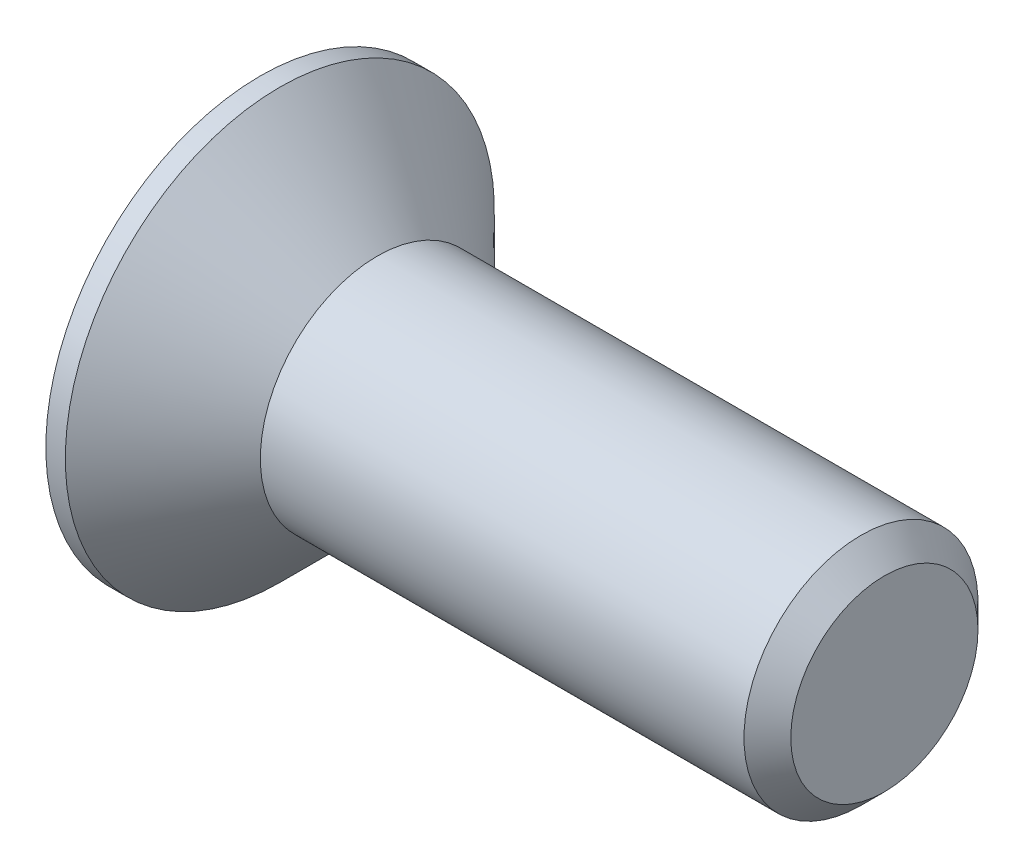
from build123d import *

# Parameters (mm, degrees)
CHAMFER1_SIZE      = 0.6
CUT_EXTRUDE1_DEPTH = 2.5


with BuildPart() as part:
    # Sketch1 → Revolve1 (revolve)
    with BuildSketch(Plane.XY, mode=Mode.PRIVATE) as revolve1_sk:
        Polygon((-3, 5.5), (-3, 0), (13, 0), (13, 3), (0, 3), (-2.5, 5.5), align=None)
    revolve(revolve1_sk.sketch.rotate(Axis((-3, 0, 0), (1, 0, 0)), 180), axis=Axis((-3, 0, 0), (1, 0, 0)))

    # Chamfer1
    chamfer1_edges = [part.edges().sort_by_distance(p)[0] for p in [
        (13, 3, 0),
    ]]
    chamfer(chamfer1_edges, length=CHAMFER1_SIZE)

    # Sketch2 → Cut-Extrude1 (cut)
    with BuildSketch(Plane.ZY.offset(3)):
        Polygon((-0.825, 3.3), (0.825, 3.3), (0.825, 0.825), (3.3, 0.825), (3.3, -0.825), (0.825, -0.825), (0.825, -3.3), (-0.825, -3.3), (-0.825, -0.825), (-3.3, -0.825), (-3.3, 0.825), (-0.825, 0.825), align=None)
    extrude(amount=-CUT_EXTRUDE1_DEPTH, mode=Mode.SUBTRACT)


solid = part.part
